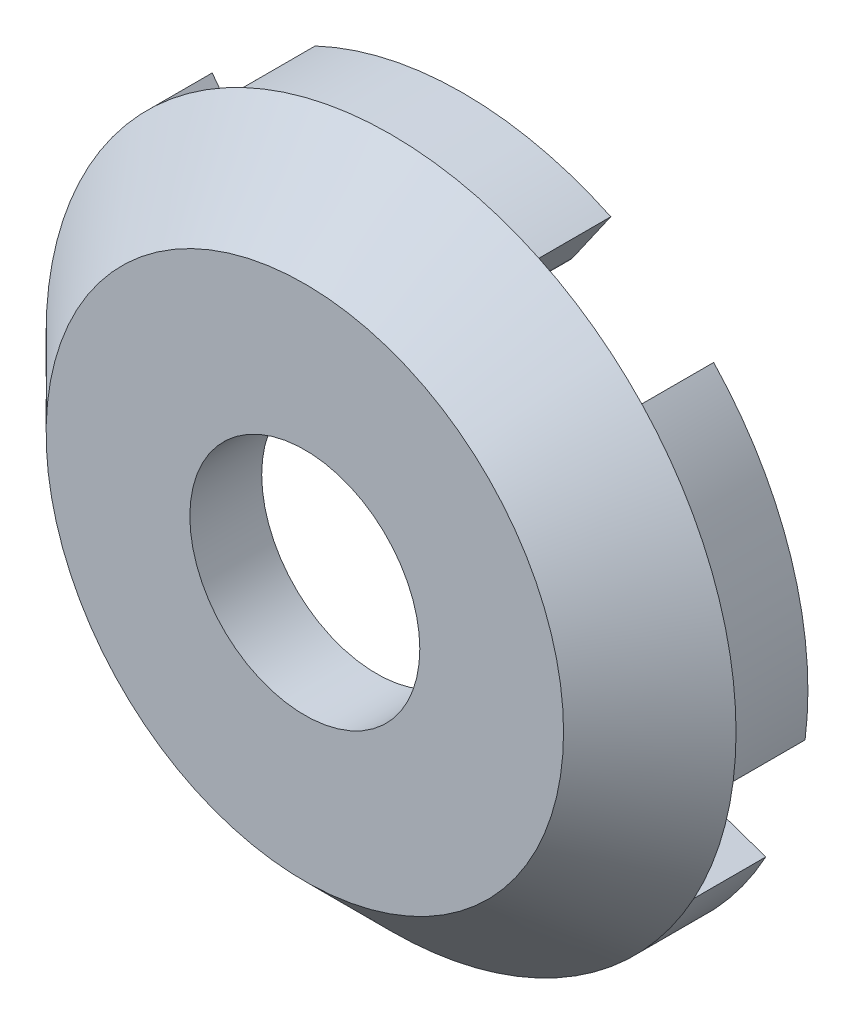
ISO-10303-21;
HEADER;
FILE_DESCRIPTION(('STEP AP214'),'2;1');
FILE_NAME('part.step','',(''),(''),'','','');
FILE_SCHEMA(('AUTOMOTIVE_DESIGN { 1 0 10303 214 1 1 1 1 }'));
ENDSEC;
DATA;
#1=APPLICATION_CONTEXT('core data for automotive mechanical design processes');
#2=APPLICATION_PROTOCOL_DEFINITION('international standard','automotive_design',2000,#1);
#3=PRODUCT_CONTEXT('',#1,'mechanical');
#4=PRODUCT('Part','Part','',(#3));
#5=PRODUCT_RELATED_PRODUCT_CATEGORY('part','',(#4));
#6=PRODUCT_DEFINITION_FORMATION('','',#4);
#7=PRODUCT_DEFINITION_CONTEXT('part definition',#1,'design');
#8=PRODUCT_DEFINITION('design','',#6,#7);
#9=PRODUCT_DEFINITION_SHAPE('','',#8);
#10=(LENGTH_UNIT() NAMED_UNIT(*) SI_UNIT(.MILLI.,.METRE.));
#11=(NAMED_UNIT(*) PLANE_ANGLE_UNIT() SI_UNIT($,.RADIAN.));
#12=(NAMED_UNIT(*) SI_UNIT($,.STERADIAN.) SOLID_ANGLE_UNIT());
#13=UNCERTAINTY_MEASURE_WITH_UNIT(LENGTH_MEASURE(1.E-05),#10,'distance_accuracy_value','');
#14=(GEOMETRIC_REPRESENTATION_CONTEXT(3) GLOBAL_UNCERTAINTY_ASSIGNED_CONTEXT((#13)) GLOBAL_UNIT_ASSIGNED_CONTEXT((#10,
#11,#12)) REPRESENTATION_CONTEXT('',''));
#15=CARTESIAN_POINT('',(0.,0.,0.));
#16=DIRECTION('',(0.,0.,1.));
#17=DIRECTION('',(1.,0.,0.));
#18=AXIS2_PLACEMENT_3D('',#15,#16,#17);
#19=CARTESIAN_POINT('',(0.,0.,2.5));
#20=DIRECTION('',(0.,0.,1.));
#21=DIRECTION('',(1.,0.,0.));
#22=AXIS2_PLACEMENT_3D('',#19,#20,#21);
#23=PLANE('',#22);
#24=DIRECTION('',(-0.603003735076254,-0.797738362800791,0.));
#25=VECTOR('',#24,1.);
#26=CARTESIAN_POINT('',(6.75879444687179,5.64488400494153,2.5));
#27=LINE('',#26,#25);
#28=CARTESIAN_POINT('',(8.72186453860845,8.24190991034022,2.5));
#29=VERTEX_POINT('',#28);
#30=CARTESIAN_POINT('',(7.34038037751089,6.41428787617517,2.5));
#31=VERTEX_POINT('',#30);
#32=EDGE_CURVE('E294',#29,#31,#27,.T.);
#33=ORIENTED_EDGE('',*,*,#32,.T.);
#34=CARTESIAN_POINT('',(8.13811874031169,5.81128414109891,2.5));
#35=DIRECTION('',(0.,0.,1.));
#36=DIRECTION('',(1.,0.,0.));
#37=AXIS2_PLACEMENT_3D('',#34,#35,#36);
#38=CIRCLE('',#37,1.);
#39=CARTESIAN_POINT('',(7.32430686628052,5.23015572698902,2.5));
#40=VERTEX_POINT('',#39);
#41=EDGE_CURVE('E461',#31,#40,#38,.T.);
#42=ORIENTED_EDGE('',*,*,#41,.T.);
#43=CARTESIAN_POINT('',(0.,0.,2.5));
#44=DIRECTION('',(0.,0.,1.));
#45=DIRECTION('',(1.,0.,0.));
#46=AXIS2_PLACEMENT_3D('',#43,#44,#45);
#47=CIRCLE('',#46,9.);
#48=CARTESIAN_POINT('',(2.71083839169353,8.58203677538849,2.5));
#49=VERTEX_POINT('',#48);
#50=EDGE_CURVE('E354',#40,#49,#47,.T.);
#51=ORIENTED_EDGE('',*,*,#50,.T.);
#52=CARTESIAN_POINT('',(3.01204265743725,9.53559641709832,2.5));
#53=DIRECTION('',(0.,0.,1.));
#54=DIRECTION('',(1.,0.,0.));
#55=AXIS2_PLACEMENT_3D('',#52,#53,#54);
#56=CIRCLE('',#55,1.);
#57=CARTESIAN_POINT('',(3.83204800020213,8.96324055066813,2.5));
#58=VERTEX_POINT('',#57);
#59=EDGE_CURVE('E447',#49,#58,#56,.T.);
#60=ORIENTED_EDGE('',*,*,#59,.T.);
#61=DIRECTION('',(0.572355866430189,0.82000534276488,0.));
#62=VECTOR('',#61,1.);
#63=CARTESIAN_POINT('',(5.14331776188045,10.8418763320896,2.5));
#64=LINE('',#63,#62);
#65=CARTESIAN_POINT('',(5.14331776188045,10.8418763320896,2.5));
#66=VERTEX_POINT('',#65);
#67=EDGE_CURVE('E518',#58,#66,#64,.T.);
#68=ORIENTED_EDGE('',*,*,#67,.T.);
#69=CARTESIAN_POINT('',(0.,0.,2.5));
#70=DIRECTION('',(0.,0.,1.));
#71=DIRECTION('',(1.,0.,0.));
#72=AXIS2_PLACEMENT_3D('',#69,#70,#71);
#73=CIRCLE('',#72,12.);
#74=EDGE_CURVE('E274',#29,#66,#73,.T.);
#75=ORIENTED_EDGE('',*,*,#74,.F.);
#76=EDGE_LOOP('',(#33,#42,#51,#60,#68,#75));
#77=FACE_BOUND('',#76,.T.);
#78=ADVANCED_FACE('F34',(#77),#23,.F.);
#79=DIRECTION('',(0.572355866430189,-0.82000534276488,0.));
#80=VECTOR('',#79,1.);
#81=CARTESIAN_POINT('',(-3.28002137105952,8.17236058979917,2.5));
#82=LINE('',#81,#80);
#83=CARTESIAN_POINT('',(-5.14331776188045,10.8418763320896,2.5));
#84=VERTEX_POINT('',#83);
#85=CARTESIAN_POINT('',(-3.83204800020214,8.96324055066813,2.5));
#86=VERTEX_POINT('',#85);
#87=EDGE_CURVE('E521',#84,#86,#82,.T.);
#88=ORIENTED_EDGE('',*,*,#87,.T.);
#89=CARTESIAN_POINT('',(-3.01204265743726,9.53559641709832,2.5));
#90=DIRECTION('',(0.,0.,1.));
#91=DIRECTION('',(1.,0.,0.));
#92=AXIS2_PLACEMENT_3D('',#89,#90,#91);
#93=CIRCLE('',#92,1.);
#94=CARTESIAN_POINT('',(-2.71083839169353,8.58203677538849,2.5));
#95=VERTEX_POINT('',#94);
#96=EDGE_CURVE('E449',#86,#95,#93,.T.);
#97=ORIENTED_EDGE('',*,*,#96,.T.);
#98=CARTESIAN_POINT('',(-7.32430686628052,5.23015572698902,2.5));
#99=VERTEX_POINT('',#98);
#100=EDGE_CURVE('E352',#95,#99,#47,.T.);
#101=ORIENTED_EDGE('',*,*,#100,.T.);
#102=CARTESIAN_POINT('',(-8.13811874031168,5.81128414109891,2.5));
#103=DIRECTION('',(0.,0.,1.));
#104=DIRECTION('',(1.,0.,0.));
#105=AXIS2_PLACEMENT_3D('',#102,#103,#104);
#106=CIRCLE('',#105,1.);
#107=CARTESIAN_POINT('',(-7.34038037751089,6.41428787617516,2.5));
#108=VERTEX_POINT('',#107);
#109=EDGE_CURVE('E238',#99,#108,#106,.T.);
#110=ORIENTED_EDGE('',*,*,#109,.T.);
#111=DIRECTION('',(-0.603003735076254,0.797738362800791,0.));
#112=VECTOR('',#111,1.);
#113=CARTESIAN_POINT('',(-6.7587944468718,5.64488400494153,2.5));
#114=LINE('',#113,#112);
#115=CARTESIAN_POINT('',(-8.72186453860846,8.24190991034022,2.5));
#116=VERTEX_POINT('',#115);
#117=EDGE_CURVE('E230',#108,#116,#114,.T.);
#118=ORIENTED_EDGE('',*,*,#117,.T.);
#119=EDGE_CURVE('E235',#84,#116,#73,.T.);
#120=ORIENTED_EDGE('',*,*,#119,.F.);
#121=EDGE_LOOP('',(#88,#97,#101,#110,#118,#120));
#122=FACE_BOUND('',#121,.T.);
#123=ADVANCED_FACE('F233',(#122),#23,.F.);
#124=DIRECTION('',(0.956739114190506,0.290947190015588,0.));
#125=VECTOR('',#124,1.);
#126=CARTESIAN_POINT('',(-8.78595913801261,-0.594087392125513,2.5));
#127=LINE('',#126,#125);
#128=CARTESIAN_POINT('',(-11.9006097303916,-1.5412618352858,2.5));
#129=VERTEX_POINT('',#128);
#130=CARTESIAN_POINT('',(-9.70871628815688,-0.87470056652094,2.5));
#131=VERTEX_POINT('',#130);
#132=EDGE_CURVE('E243',#129,#131,#127,.T.);
#133=ORIENTED_EDGE('',*,*,#132,.T.);
#134=CARTESIAN_POINT('',(-9.99966347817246,0.0820385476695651,2.5));
#135=DIRECTION('',(0.,0.,1.));
#136=DIRECTION('',(1.,0.,0.));
#137=AXIS2_PLACEMENT_3D('',#134,#135,#136);
#138=CIRCLE('',#137,1.);
#139=CARTESIAN_POINT('',(-8.99969713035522,0.0738346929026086,2.5));
#140=VERTEX_POINT('',#139);
#141=EDGE_CURVE('E452',#131,#140,#138,.T.);
#142=ORIENTED_EDGE('',*,*,#141,.T.);
#143=CARTESIAN_POINT('',(-7.23750897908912,-5.34962276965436,2.5));
#144=VERTEX_POINT('',#143);
#145=EDGE_CURVE('E350',#140,#144,#47,.T.);
#146=ORIENTED_EDGE('',*,*,#145,.T.);
#147=CARTESIAN_POINT('',(-8.04167664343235,-5.94402529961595,2.5));
#148=DIRECTION('',(0.,0.,1.));
#149=DIRECTION('',(1.,0.,0.));
#150=AXIS2_PLACEMENT_3D('',#147,#148,#149);
#151=CIRCLE('',#150,1.);
#152=CARTESIAN_POINT('',(-8.36865256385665,-4.9989926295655,2.5));
#153=VERTEX_POINT('',#152);
#154=EDGE_CURVE('E456',#144,#153,#151,.T.);
#155=ORIENTED_EDGE('',*,*,#154,.T.);
#156=DIRECTION('',(-0.945032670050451,-0.326975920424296,0.));
#157=VECTOR('',#156,1.);
#158=CARTESIAN_POINT('',(-7.45718606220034,-4.68363041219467,2.5));
#159=LINE('',#158,#157);
#160=CARTESIAN_POINT('',(-10.5337264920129,-5.74809587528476,2.5));
#161=VERTEX_POINT('',#160);
#162=EDGE_CURVE('E334',#153,#161,#159,.T.);
#163=ORIENTED_EDGE('',*,*,#162,.T.);
#164=EDGE_CURVE('E272',#129,#161,#73,.T.);
#165=ORIENTED_EDGE('',*,*,#164,.F.);
#166=EDGE_LOOP('',(#133,#142,#146,#155,#163,#165));
#167=FACE_BOUND('',#166,.T.);
#168=ADVANCED_FACE('F597',(#167),#23,.F.);
#169=DIRECTION('',(0.0189414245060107,0.999820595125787,0.));
#170=VECTOR('',#169,1.);
#171=CARTESIAN_POINT('',(-2.15,-8.53952679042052,2.5));
#172=LINE('',#171,#170);
#173=CARTESIAN_POINT('',(-2.21166353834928,-11.7944285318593,2.5));
#174=VERTEX_POINT('',#173);
#175=CARTESIAN_POINT('',(-2.16826865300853,-9.50383523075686,2.5));
#176=VERTEX_POINT('',#175);
#177=EDGE_CURVE('E330',#174,#176,#172,.T.);
#178=ORIENTED_EDGE('',*,*,#177,.T.);
#179=CARTESIAN_POINT('',(-3.16808924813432,-9.48489380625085,2.5));
#180=DIRECTION('',(0.,0.,1.));
#181=DIRECTION('',(1.,0.,0.));
#182=AXIS2_PLACEMENT_3D('',#179,#180,#181);
#183=CIRCLE('',#182,1.);
#184=CARTESIAN_POINT('',(-2.85128032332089,-8.53640442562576,2.5));
#185=VERTEX_POINT('',#184);
#186=EDGE_CURVE('E458',#176,#185,#183,.T.);
#187=ORIENTED_EDGE('',*,*,#186,.T.);
#188=CARTESIAN_POINT('',(2.85128032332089,-8.53640442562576,2.5));
#189=VERTEX_POINT('',#188);
#190=EDGE_CURVE('E567',#185,#189,#47,.T.);
#191=ORIENTED_EDGE('',*,*,#190,.T.);
#192=CARTESIAN_POINT('',(3.16808924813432,-9.48489380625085,2.5));
#193=DIRECTION('',(0.,0.,1.));
#194=DIRECTION('',(1.,0.,0.));
#195=AXIS2_PLACEMENT_3D('',#192,#193,#194);
#196=CIRCLE('',#195,1.);
#197=CARTESIAN_POINT('',(2.16826865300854,-9.50383523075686,2.5));
#198=VERTEX_POINT('',#197);
#199=EDGE_CURVE('E11',#189,#198,#196,.T.);
#200=ORIENTED_EDGE('',*,*,#199,.T.);
#201=DIRECTION('',(0.0189414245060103,-0.999820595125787,0.));
#202=VECTOR('',#201,1.);
#203=CARTESIAN_POINT('',(2.15,-8.53952679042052,2.5));
#204=LINE('',#203,#202);
#205=CARTESIAN_POINT('',(2.21166353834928,-11.7944285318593,2.5));
#206=VERTEX_POINT('',#205);
#207=EDGE_CURVE('E316',#198,#206,#204,.T.);
#208=ORIENTED_EDGE('',*,*,#207,.T.);
#209=EDGE_CURVE('E277',#174,#206,#73,.T.);
#210=ORIENTED_EDGE('',*,*,#209,.F.);
#211=EDGE_LOOP('',(#178,#187,#191,#200,#208,#210));
#212=FACE_BOUND('',#211,.T.);
#213=ADVANCED_FACE('F568',(#212),#23,.F.);
#214=CARTESIAN_POINT('',(0.,0.,5.5));
#215=DIRECTION('',(0.,0.,-1.));
#216=DIRECTION('',(-1.,0.,0.));
#217=AXIS2_PLACEMENT_3D('',#214,#215,#216);
#218=CYLINDRICAL_SURFACE('',#217,4.);
#219=CARTESIAN_POINT('',(0.,0.,5.5));
#220=DIRECTION('',(0.,0.,1.));
#221=DIRECTION('',(1.,0.,0.));
#222=AXIS2_PLACEMENT_3D('',#219,#220,#221);
#223=CIRCLE('',#222,4.);
#224=CARTESIAN_POINT('',(4.,0.,5.5));
#225=VERTEX_POINT('',#224);
#226=EDGE_CURVE('E281',#225,#225,#223,.T.);
#227=ORIENTED_EDGE('',*,*,#226,.T.);
#228=EDGE_LOOP('',(#227));
#229=FACE_BOUND('',#228,.T.);
#230=CARTESIAN_POINT('',(0.,0.,3.));
#231=DIRECTION('',(0.,0.,-1.));
#232=DIRECTION('',(-1.,0.,0.));
#233=AXIS2_PLACEMENT_3D('',#230,#231,#232);
#234=CIRCLE('',#233,4.);
#235=CARTESIAN_POINT('',(-4.,0.,3.));
#236=VERTEX_POINT('',#235);
#237=EDGE_CURVE('E347',#236,#236,#234,.T.);
#238=ORIENTED_EDGE('',*,*,#237,.T.);
#239=EDGE_LOOP('',(#238));
#240=FACE_BOUND('',#239,.T.);
#241=ADVANCED_FACE('F630',(#229,#240),#218,.F.);
#242=CARTESIAN_POINT('',(0.,0.,2.5));
#243=DIRECTION('',(0.,0.,-1.));
#244=DIRECTION('',(-1.,0.,0.));
#245=AXIS2_PLACEMENT_3D('',#242,#243,#244);
#246=CYLINDRICAL_SURFACE('',#245,12.);
#247=DIRECTION('',(0.,0.,-1.));
#248=VECTOR('',#247,1.);
#249=CARTESIAN_POINT('',(10.5337264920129,-5.74809587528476,2.5));
#250=LINE('',#249,#248);
#251=CARTESIAN_POINT('',(10.5337264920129,-5.74809587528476,2.5));
#252=VERTEX_POINT('',#251);
#253=CARTESIAN_POINT('',(10.5337264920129,-5.74809587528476,0.));
#254=VERTEX_POINT('',#253);
#255=EDGE_CURVE('E309',#252,#254,#250,.T.);
#256=ORIENTED_EDGE('',*,*,#255,.F.);
#257=CARTESIAN_POINT('',(0.,0.,2.49999999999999));
#258=DIRECTION('',(0.,0.,1.));
#259=DIRECTION('',(1.,0.,0.));
#260=AXIS2_PLACEMENT_3D('',#257,#258,#259);
#261=CIRCLE('',#260,12.);
#262=EDGE_CURVE('E483',#252,#206,#261,.F.);
#263=ORIENTED_EDGE('',*,*,#262,.T.);
#264=DIRECTION('',(0.,0.,-1.));
#265=VECTOR('',#264,1.);
#266=CARTESIAN_POINT('',(2.21166353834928,-11.7944285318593,2.5));
#267=LINE('',#266,#265);
#268=CARTESIAN_POINT('',(2.21166353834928,-11.7944285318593,0.));
#269=VERTEX_POINT('',#268);
#270=EDGE_CURVE('E303',#206,#269,#267,.T.);
#271=ORIENTED_EDGE('',*,*,#270,.T.);
#272=CARTESIAN_POINT('',(0.,0.,0.));
#273=DIRECTION('',(0.,0.,1.));
#274=DIRECTION('',(1.,0.,0.));
#275=AXIS2_PLACEMENT_3D('',#272,#273,#274);
#276=CIRCLE('',#275,12.);
#277=EDGE_CURVE('E317',#269,#254,#276,.T.);
#278=ORIENTED_EDGE('',*,*,#277,.T.);
#279=EDGE_LOOP('',(#256,#263,#271,#278));
#280=FACE_BOUND('',#279,.T.);
#281=ADVANCED_FACE('F482',(#280),#246,.T.);
#282=DIRECTION('',(0.,0.,-1.));
#283=VECTOR('',#282,1.);
#284=CARTESIAN_POINT('',(-2.21166353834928,-11.7944285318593,2.5));
#285=LINE('',#284,#283);
#286=CARTESIAN_POINT('',(-2.21166353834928,-11.7944285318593,0.));
#287=VERTEX_POINT('',#286);
#288=EDGE_CURVE('E327',#174,#287,#285,.T.);
#289=ORIENTED_EDGE('',*,*,#288,.F.);
#290=CARTESIAN_POINT('',(0.,0.,2.49999999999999));
#291=DIRECTION('',(0.,0.,1.));
#292=DIRECTION('',(1.,0.,0.));
#293=AXIS2_PLACEMENT_3D('',#290,#291,#292);
#294=CIRCLE('',#293,12.);
#295=EDGE_CURVE('E259',#174,#161,#294,.F.);
#296=ORIENTED_EDGE('',*,*,#295,.T.);
#297=DIRECTION('',(0.,0.,-1.));
#298=VECTOR('',#297,1.);
#299=CARTESIAN_POINT('',(-10.5337264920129,-5.74809587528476,2.5));
#300=LINE('',#299,#298);
#301=CARTESIAN_POINT('',(-10.5337264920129,-5.74809587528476,0.));
#302=VERTEX_POINT('',#301);
#303=EDGE_CURVE('E321',#161,#302,#300,.T.);
#304=ORIENTED_EDGE('',*,*,#303,.T.);
#305=CARTESIAN_POINT('',(0.,0.,0.));
#306=DIRECTION('',(0.,0.,1.));
#307=DIRECTION('',(1.,0.,0.));
#308=AXIS2_PLACEMENT_3D('',#305,#306,#307);
#309=CIRCLE('',#308,12.);
#310=EDGE_CURVE('E335',#302,#287,#309,.T.);
#311=ORIENTED_EDGE('',*,*,#310,.T.);
#312=EDGE_LOOP('',(#289,#296,#304,#311));
#313=FACE_BOUND('',#312,.T.);
#314=ADVANCED_FACE('F585',(#313),#246,.T.);
#315=DIRECTION('',(0.,0.,-1.));
#316=VECTOR('',#315,1.);
#317=CARTESIAN_POINT('',(-11.9006097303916,-1.5412618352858,2.5));
#318=LINE('',#317,#316);
#319=CARTESIAN_POINT('',(-11.9006097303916,-1.5412618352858,0.));
#320=VERTEX_POINT('',#319);
#321=EDGE_CURVE('E255',#129,#320,#318,.T.);
#322=ORIENTED_EDGE('',*,*,#321,.F.);
#323=CARTESIAN_POINT('',(0.,0.,2.49999999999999));
#324=DIRECTION('',(0.,0.,1.));
#325=DIRECTION('',(1.,0.,0.));
#326=AXIS2_PLACEMENT_3D('',#323,#324,#325);
#327=CIRCLE('',#326,12.);
#328=EDGE_CURVE('E250',#129,#116,#327,.F.);
#329=ORIENTED_EDGE('',*,*,#328,.T.);
#330=DIRECTION('',(0.,0.,-1.));
#331=VECTOR('',#330,1.);
#332=CARTESIAN_POINT('',(-8.72186453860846,8.24190991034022,2.5));
#333=LINE('',#332,#331);
#334=CARTESIAN_POINT('',(-8.72186453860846,8.24190991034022,0.));
#335=VERTEX_POINT('',#334);
#336=EDGE_CURVE('E252',#116,#335,#333,.T.);
#337=ORIENTED_EDGE('',*,*,#336,.T.);
#338=CARTESIAN_POINT('',(0.,0.,0.));
#339=DIRECTION('',(0.,0.,1.));
#340=DIRECTION('',(1.,0.,0.));
#341=AXIS2_PLACEMENT_3D('',#338,#339,#340);
#342=CIRCLE('',#341,12.);
#343=EDGE_CURVE('E344',#335,#320,#342,.T.);
#344=ORIENTED_EDGE('',*,*,#343,.T.);
#345=EDGE_LOOP('',(#322,#329,#337,#344));
#346=FACE_BOUND('',#345,.T.);
#347=ADVANCED_FACE('F251',(#346),#246,.T.);
#348=DIRECTION('',(0.,0.,-1.));
#349=VECTOR('',#348,1.);
#350=CARTESIAN_POINT('',(-5.14331776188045,10.8418763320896,2.5));
#351=LINE('',#350,#349);
#352=CARTESIAN_POINT('',(-5.14331776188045,10.8418763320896,0.));
#353=VERTEX_POINT('',#352);
#354=EDGE_CURVE('E517',#84,#353,#351,.T.);
#355=ORIENTED_EDGE('',*,*,#354,.F.);
#356=CARTESIAN_POINT('',(0.,0.,2.49999999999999));
#357=DIRECTION('',(0.,0.,1.));
#358=DIRECTION('',(1.,0.,0.));
#359=AXIS2_PLACEMENT_3D('',#356,#357,#358);
#360=CIRCLE('',#359,12.);
#361=EDGE_CURVE('E260',#84,#66,#360,.F.);
#362=ORIENTED_EDGE('',*,*,#361,.T.);
#363=DIRECTION('',(0.,0.,-1.));
#364=VECTOR('',#363,1.);
#365=CARTESIAN_POINT('',(5.14331776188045,10.8418763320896,2.5));
#366=LINE('',#365,#364);
#367=CARTESIAN_POINT('',(5.14331776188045,10.8418763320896,0.));
#368=VERTEX_POINT('',#367);
#369=EDGE_CURVE('E523',#66,#368,#366,.T.);
#370=ORIENTED_EDGE('',*,*,#369,.T.);
#371=CARTESIAN_POINT('',(0.,0.,0.));
#372=DIRECTION('',(0.,0.,1.));
#373=DIRECTION('',(1.,0.,0.));
#374=AXIS2_PLACEMENT_3D('',#371,#372,#373);
#375=CIRCLE('',#374,12.);
#376=EDGE_CURVE('E275',#368,#353,#375,.T.);
#377=ORIENTED_EDGE('',*,*,#376,.T.);
#378=EDGE_LOOP('',(#355,#362,#370,#377));
#379=FACE_BOUND('',#378,.T.);
#380=ADVANCED_FACE('F535',(#379),#246,.T.);
#381=DIRECTION('',(-0.945032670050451,0.326975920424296,0.));
#382=VECTOR('',#381,1.);
#383=CARTESIAN_POINT('',(7.45718606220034,-4.68363041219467,2.5));
#384=LINE('',#383,#382);
#385=CARTESIAN_POINT('',(8.36865256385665,-4.9989926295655,2.5));
#386=VERTEX_POINT('',#385);
#387=EDGE_CURVE('E312',#252,#386,#384,.T.);
#388=ORIENTED_EDGE('',*,*,#387,.T.);
#389=CARTESIAN_POINT('',(8.04167664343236,-5.94402529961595,2.5));
#390=DIRECTION('',(0.,0.,1.));
#391=DIRECTION('',(1.,0.,0.));
#392=AXIS2_PLACEMENT_3D('',#389,#390,#391);
#393=CIRCLE('',#392,1.);
#394=CARTESIAN_POINT('',(7.23750897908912,-5.34962276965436,2.5));
#395=VERTEX_POINT('',#394);
#396=EDGE_CURVE('E42',#386,#395,#393,.T.);
#397=ORIENTED_EDGE('',*,*,#396,.T.);
#398=CARTESIAN_POINT('',(8.99969713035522,0.0738346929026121,2.5));
#399=VERTEX_POINT('',#398);
#400=EDGE_CURVE('E468',#395,#399,#47,.T.);
#401=ORIENTED_EDGE('',*,*,#400,.T.);
#402=CARTESIAN_POINT('',(9.99966347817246,0.082038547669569,2.5));
#403=DIRECTION('',(0.,0.,1.));
#404=DIRECTION('',(1.,0.,0.));
#405=AXIS2_PLACEMENT_3D('',#402,#403,#404);
#406=CIRCLE('',#405,1.);
#407=CARTESIAN_POINT('',(9.70871628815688,-0.874700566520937,2.5));
#408=VERTEX_POINT('',#407);
#409=EDGE_CURVE('E464',#399,#408,#406,.T.);
#410=ORIENTED_EDGE('',*,*,#409,.T.);
#411=DIRECTION('',(0.956739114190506,-0.290947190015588,0.));
#412=VECTOR('',#411,1.);
#413=CARTESIAN_POINT('',(8.78595913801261,-0.594087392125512,2.5));
#414=LINE('',#413,#412);
#415=CARTESIAN_POINT('',(11.9006097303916,-1.54126183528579,2.5));
#416=VERTEX_POINT('',#415);
#417=EDGE_CURVE('E298',#408,#416,#414,.T.);
#418=ORIENTED_EDGE('',*,*,#417,.T.);
#419=EDGE_CURVE('E280',#252,#416,#73,.T.);
#420=ORIENTED_EDGE('',*,*,#419,.F.);
#421=EDGE_LOOP('',(#388,#397,#401,#410,#418,#420));
#422=FACE_BOUND('',#421,.T.);
#423=ADVANCED_FACE('F467',(#422),#23,.F.);
#424=CARTESIAN_POINT('',(5.14331776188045,10.8418763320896,2.5));
#425=DIRECTION('',(-0.82000534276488,0.572355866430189,0.));
#426=DIRECTION('',(-0.572355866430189,-0.82000534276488,0.));
#427=AXIS2_PLACEMENT_3D('',#424,#425,#426);
#428=PLANE('',#427);
#429=ORIENTED_EDGE('',*,*,#67,.F.);
#430=DIRECTION('',(0.,0.,-1.));
#431=VECTOR('',#430,1.);
#432=CARTESIAN_POINT('',(3.83204800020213,8.96324055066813,2.5));
#433=LINE('',#432,#431);
#434=CARTESIAN_POINT('',(3.83204800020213,8.96324055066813,0.));
#435=VERTEX_POINT('',#434);
#436=EDGE_CURVE('E494',#58,#435,#433,.T.);
#437=ORIENTED_EDGE('',*,*,#436,.T.);
#438=DIRECTION('',(0.572355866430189,0.82000534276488,0.));
#439=VECTOR('',#438,1.);
#440=CARTESIAN_POINT('',(5.14331776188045,10.8418763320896,0.));
#441=LINE('',#440,#439);
#442=EDGE_CURVE('E271',#435,#368,#441,.T.);
#443=ORIENTED_EDGE('',*,*,#442,.T.);
#444=ORIENTED_EDGE('',*,*,#369,.F.);
#445=EDGE_LOOP('',(#429,#437,#443,#444));
#446=FACE_BOUND('',#445,.T.);
#447=ADVANCED_FACE('F538',(#446),#428,.F.);
#448=DIRECTION('',(0.,0.,-1.));
#449=VECTOR('',#448,1.);
#450=CARTESIAN_POINT('',(8.72186453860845,8.24190991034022,2.5));
#451=LINE('',#450,#449);
#452=CARTESIAN_POINT('',(8.72186453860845,8.24190991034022,0.));
#453=VERTEX_POINT('',#452);
#454=EDGE_CURVE('E289',#29,#453,#451,.T.);
#455=ORIENTED_EDGE('',*,*,#454,.F.);
#456=CARTESIAN_POINT('',(0.,0.,2.49999999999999));
#457=DIRECTION('',(0.,0.,1.));
#458=DIRECTION('',(1.,0.,0.));
#459=AXIS2_PLACEMENT_3D('',#456,#457,#458);
#460=CIRCLE('',#459,12.);
#461=EDGE_CURVE('E487',#29,#416,#460,.F.);
#462=ORIENTED_EDGE('',*,*,#461,.T.);
#463=DIRECTION('',(0.,0.,-1.));
#464=VECTOR('',#463,1.);
#465=CARTESIAN_POINT('',(11.9006097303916,-1.54126183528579,2.5));
#466=LINE('',#465,#464);
#467=CARTESIAN_POINT('',(11.9006097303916,-1.54126183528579,0.));
#468=VERTEX_POINT('',#467);
#469=EDGE_CURVE('E285',#416,#468,#466,.T.);
#470=ORIENTED_EDGE('',*,*,#469,.T.);
#471=CARTESIAN_POINT('',(0.,0.,0.));
#472=DIRECTION('',(0.,0.,1.));
#473=DIRECTION('',(1.,0.,0.));
#474=AXIS2_PLACEMENT_3D('',#471,#472,#473);
#475=CIRCLE('',#474,12.);
#476=EDGE_CURVE('E299',#468,#453,#475,.T.);
#477=ORIENTED_EDGE('',*,*,#476,.T.);
#478=EDGE_LOOP('',(#455,#462,#470,#477));
#479=FACE_BOUND('',#478,.T.);
#480=ADVANCED_FACE('F558',(#479),#246,.T.);
#481=CARTESIAN_POINT('',(-3.28002137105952,8.17236058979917,2.5));
#482=DIRECTION('',(0.82000534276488,0.572355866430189,0.));
#483=DIRECTION('',(-0.572355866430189,0.82000534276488,0.));
#484=AXIS2_PLACEMENT_3D('',#481,#482,#483);
#485=PLANE('',#484);
#486=DIRECTION('',(0.572355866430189,-0.82000534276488,0.));
#487=VECTOR('',#486,1.);
#488=CARTESIAN_POINT('',(-3.28002137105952,8.17236058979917,0.));
#489=LINE('',#488,#487);
#490=CARTESIAN_POINT('',(-3.83204800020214,8.96324055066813,0.));
#491=VERTEX_POINT('',#490);
#492=EDGE_CURVE('E509',#353,#491,#489,.T.);
#493=ORIENTED_EDGE('',*,*,#492,.T.);
#494=DIRECTION('',(0.,0.,-1.));
#495=VECTOR('',#494,1.);
#496=CARTESIAN_POINT('',(-3.83204800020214,8.96324055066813,2.5));
#497=LINE('',#496,#495);
#498=EDGE_CURVE('E407',#491,#86,#497,.F.);
#499=ORIENTED_EDGE('',*,*,#498,.T.);
#500=ORIENTED_EDGE('',*,*,#87,.F.);
#501=ORIENTED_EDGE('',*,*,#354,.T.);
#502=EDGE_LOOP('',(#493,#499,#500,#501));
#503=FACE_BOUND('',#502,.T.);
#504=ADVANCED_FACE('F515',(#503),#485,.F.);
#505=CARTESIAN_POINT('',(0.,10.4617840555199,0.));
#506=DIRECTION('',(0.,0.,1.));
#507=DIRECTION('',(1.,0.,0.));
#508=AXIS2_PLACEMENT_3D('',#505,#506,#507);
#509=PLANE('',#508);
#510=ORIENTED_EDGE('',*,*,#442,.F.);
#511=CARTESIAN_POINT('',(3.01204265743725,9.53559641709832,0.));
#512=DIRECTION('',(0.,0.,1.));
#513=DIRECTION('',(1.,0.,0.));
#514=AXIS2_PLACEMENT_3D('',#511,#512,#513);
#515=CIRCLE('',#514,1.);
#516=CARTESIAN_POINT('',(2.71083839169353,8.58203677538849,0.));
#517=VERTEX_POINT('',#516);
#518=EDGE_CURVE('E382',#435,#517,#515,.F.);
#519=ORIENTED_EDGE('',*,*,#518,.T.);
#520=CARTESIAN_POINT('',(0.,0.,0.));
#521=DIRECTION('',(0.,0.,-1.));
#522=DIRECTION('',(-1.,0.,0.));
#523=AXIS2_PLACEMENT_3D('',#520,#521,#522);
#524=CIRCLE('',#523,9.);
#525=CARTESIAN_POINT('',(-2.71083839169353,8.58203677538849,0.));
#526=VERTEX_POINT('',#525);
#527=EDGE_CURVE('E359',#526,#517,#524,.T.);
#528=ORIENTED_EDGE('',*,*,#527,.F.);
#529=CARTESIAN_POINT('',(-3.01204265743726,9.53559641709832,0.));
#530=DIRECTION('',(0.,0.,1.));
#531=DIRECTION('',(1.,0.,0.));
#532=AXIS2_PLACEMENT_3D('',#529,#530,#531);
#533=CIRCLE('',#532,1.);
#534=EDGE_CURVE('E386',#526,#491,#533,.F.);
#535=ORIENTED_EDGE('',*,*,#534,.T.);
#536=ORIENTED_EDGE('',*,*,#492,.F.);
#537=ORIENTED_EDGE('',*,*,#376,.F.);
#538=EDGE_LOOP('',(#510,#519,#528,#535,#536,#537));
#539=FACE_BOUND('',#538,.T.);
#540=ADVANCED_FACE('F507',(#539),#509,.F.);
#541=CARTESIAN_POINT('',(0.,0.,5.5));
#542=DIRECTION('',(0.,0.,1.));
#543=DIRECTION('',(1.,0.,0.));
#544=AXIS2_PLACEMENT_3D('',#541,#542,#543);
#545=PLANE('',#544);
#546=CARTESIAN_POINT('',(0.,0.,5.5));
#547=DIRECTION('',(0.,0.,1.));
#548=DIRECTION('',(1.,0.,0.));
#549=AXIS2_PLACEMENT_3D('',#546,#547,#548);
#550=CIRCLE('',#549,9.00000000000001);
#551=CARTESIAN_POINT('',(9.00000000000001,0.,5.5));
#552=VERTEX_POINT('',#551);
#553=EDGE_CURVE('E529',#552,#552,#550,.T.);
#554=ORIENTED_EDGE('',*,*,#553,.T.);
#555=EDGE_LOOP('',(#554));
#556=FACE_BOUND('',#555,.T.);
#557=ORIENTED_EDGE('',*,*,#226,.F.);
#558=EDGE_LOOP('',(#557));
#559=FACE_BOUND('',#558,.T.);
#560=ADVANCED_FACE('F682',(#556,#559),#545,.T.);
#561=CARTESIAN_POINT('',(8.78595913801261,-0.594087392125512,2.5));
#562=DIRECTION('',(0.290947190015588,0.956739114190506,0.));
#563=DIRECTION('',(-0.956739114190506,0.290947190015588,0.));
#564=AXIS2_PLACEMENT_3D('',#561,#562,#563);
#565=PLANE('',#564);
#566=ORIENTED_EDGE('',*,*,#417,.F.);
#567=DIRECTION('',(0.,0.,-1.));
#568=VECTOR('',#567,1.);
#569=CARTESIAN_POINT('',(9.70871628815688,-0.874700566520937,2.5));
#570=LINE('',#569,#568);
#571=CARTESIAN_POINT('',(9.70871628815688,-0.874700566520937,0.));
#572=VERTEX_POINT('',#571);
#573=EDGE_CURVE('E436',#408,#572,#570,.T.);
#574=ORIENTED_EDGE('',*,*,#573,.T.);
#575=DIRECTION('',(0.956739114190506,-0.290947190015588,0.));
#576=VECTOR('',#575,1.);
#577=CARTESIAN_POINT('',(8.78595913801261,-0.594087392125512,0.));
#578=LINE('',#577,#576);
#579=EDGE_CURVE('E301',#572,#468,#578,.T.);
#580=ORIENTED_EDGE('',*,*,#579,.T.);
#581=ORIENTED_EDGE('',*,*,#469,.F.);
#582=EDGE_LOOP('',(#566,#574,#580,#581));
#583=FACE_BOUND('',#582,.T.);
#584=ADVANCED_FACE('F562',(#583),#565,.F.);
#585=CARTESIAN_POINT('',(6.75879444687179,5.64488400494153,2.5));
#586=DIRECTION('',(0.797738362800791,-0.603003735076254,0.));
#587=DIRECTION('',(0.603003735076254,0.797738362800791,0.));
#588=AXIS2_PLACEMENT_3D('',#585,#586,#587);
#589=PLANE('',#588);
#590=DIRECTION('',(-0.603003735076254,-0.797738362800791,0.));
#591=VECTOR('',#590,1.);
#592=CARTESIAN_POINT('',(6.75879444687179,5.64488400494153,0.));
#593=LINE('',#592,#591);
#594=CARTESIAN_POINT('',(7.34038037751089,6.41428787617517,0.));
#595=VERTEX_POINT('',#594);
#596=EDGE_CURVE('E295',#453,#595,#593,.T.);
#597=ORIENTED_EDGE('',*,*,#596,.T.);
#598=DIRECTION('',(0.,0.,-1.));
#599=VECTOR('',#598,1.);
#600=CARTESIAN_POINT('',(7.34038037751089,6.41428787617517,2.5));
#601=LINE('',#600,#599);
#602=EDGE_CURVE('E429',#595,#31,#601,.F.);
#603=ORIENTED_EDGE('',*,*,#602,.T.);
#604=ORIENTED_EDGE('',*,*,#32,.F.);
#605=ORIENTED_EDGE('',*,*,#454,.T.);
#606=EDGE_LOOP('',(#597,#603,#604,#605));
#607=FACE_BOUND('',#606,.T.);
#608=ADVANCED_FACE('F555',(#607),#589,.F.);
#609=CARTESIAN_POINT('',(9.94974789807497,3.23286906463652,0.));
#610=DIRECTION('',(0.,0.,1.));
#611=DIRECTION('',(1.,0.,0.));
#612=AXIS2_PLACEMENT_3D('',#609,#610,#611);
#613=PLANE('',#612);
#614=CARTESIAN_POINT('',(7.32430686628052,5.23015572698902,0.));
#615=VERTEX_POINT('',#614);
#616=CARTESIAN_POINT('',(8.99969713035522,0.0738346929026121,0.));
#617=VERTEX_POINT('',#616);
#618=EDGE_CURVE('E364',#615,#617,#524,.T.);
#619=ORIENTED_EDGE('',*,*,#618,.F.);
#620=CARTESIAN_POINT('',(8.13811874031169,5.81128414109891,0.));
#621=DIRECTION('',(0.,0.,1.));
#622=DIRECTION('',(1.,0.,0.));
#623=AXIS2_PLACEMENT_3D('',#620,#621,#622);
#624=CIRCLE('',#623,1.);
#625=EDGE_CURVE('E434',#615,#595,#624,.F.);
#626=ORIENTED_EDGE('',*,*,#625,.T.);
#627=ORIENTED_EDGE('',*,*,#596,.F.);
#628=ORIENTED_EDGE('',*,*,#476,.F.);
#629=ORIENTED_EDGE('',*,*,#579,.F.);
#630=CARTESIAN_POINT('',(9.99966347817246,0.082038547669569,0.));
#631=DIRECTION('',(0.,0.,1.));
#632=DIRECTION('',(1.,0.,0.));
#633=AXIS2_PLACEMENT_3D('',#630,#631,#632);
#634=CIRCLE('',#633,1.);
#635=EDGE_CURVE('E432',#572,#617,#634,.F.);
#636=ORIENTED_EDGE('',*,*,#635,.T.);
#637=EDGE_LOOP('',(#619,#626,#627,#628,#629,#636));
#638=FACE_BOUND('',#637,.T.);
#639=ADVANCED_FACE('F552',(#638),#613,.F.);
#640=CARTESIAN_POINT('',(2.15,-8.53952679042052,2.5));
#641=DIRECTION('',(0.999820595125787,0.0189414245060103,0.));
#642=DIRECTION('',(-0.0189414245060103,0.999820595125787,0.));
#643=AXIS2_PLACEMENT_3D('',#640,#641,#642);
#644=PLANE('',#643);
#645=ORIENTED_EDGE('',*,*,#207,.F.);
#646=DIRECTION('',(0.,0.,-1.));
#647=VECTOR('',#646,1.);
#648=CARTESIAN_POINT('',(2.16826865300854,-9.50383523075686,2.5));
#649=LINE('',#648,#647);
#650=CARTESIAN_POINT('',(2.16826865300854,-9.50383523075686,0.));
#651=VERTEX_POINT('',#650);
#652=EDGE_CURVE('E445',#198,#651,#649,.T.);
#653=ORIENTED_EDGE('',*,*,#652,.T.);
#654=DIRECTION('',(0.0189414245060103,-0.999820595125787,0.));
#655=VECTOR('',#654,1.);
#656=CARTESIAN_POINT('',(2.15,-8.53952679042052,0.));
#657=LINE('',#656,#655);
#658=EDGE_CURVE('E319',#651,#269,#657,.T.);
#659=ORIENTED_EDGE('',*,*,#658,.T.);
#660=ORIENTED_EDGE('',*,*,#270,.F.);
#661=EDGE_LOOP('',(#645,#653,#659,#660));
#662=FACE_BOUND('',#661,.T.);
#663=ADVANCED_FACE('F889',(#662),#644,.F.);
#664=CARTESIAN_POINT('',(7.45718606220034,-4.68363041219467,2.5));
#665=DIRECTION('',(-0.326975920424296,-0.945032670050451,0.));
#666=DIRECTION('',(0.945032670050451,-0.326975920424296,0.));
#667=AXIS2_PLACEMENT_3D('',#664,#665,#666);
#668=PLANE('',#667);
#669=DIRECTION('',(-0.945032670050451,0.326975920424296,0.));
#670=VECTOR('',#669,1.);
#671=CARTESIAN_POINT('',(7.45718606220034,-4.68363041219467,0.));
#672=LINE('',#671,#670);
#673=CARTESIAN_POINT('',(8.36865256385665,-4.9989926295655,0.));
#674=VERTEX_POINT('',#673);
#675=EDGE_CURVE('E313',#254,#674,#672,.T.);
#676=ORIENTED_EDGE('',*,*,#675,.T.);
#677=DIRECTION('',(0.,0.,-1.));
#678=VECTOR('',#677,1.);
#679=CARTESIAN_POINT('',(8.36865256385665,-4.9989926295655,2.5));
#680=LINE('',#679,#678);
#681=EDGE_CURVE('E439',#674,#386,#680,.F.);
#682=ORIENTED_EDGE('',*,*,#681,.T.);
#683=ORIENTED_EDGE('',*,*,#387,.F.);
#684=ORIENTED_EDGE('',*,*,#255,.T.);
#685=EDGE_LOOP('',(#676,#682,#683,#684));
#686=FACE_BOUND('',#685,.T.);
#687=ADVANCED_FACE('F478',(#686),#668,.F.);
#688=CARTESIAN_POINT('',(6.14928238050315,-8.46376109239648,0.));
#689=DIRECTION('',(0.,0.,1.));
#690=DIRECTION('',(1.,0.,0.));
#691=AXIS2_PLACEMENT_3D('',#688,#689,#690);
#692=PLANE('',#691);
#693=CARTESIAN_POINT('',(7.23750897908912,-5.34962276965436,0.));
#694=VERTEX_POINT('',#693);
#695=CARTESIAN_POINT('',(2.85128032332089,-8.53640442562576,0.));
#696=VERTEX_POINT('',#695);
#697=EDGE_CURVE('E358',#694,#696,#524,.T.);
#698=ORIENTED_EDGE('',*,*,#697,.F.);
#699=CARTESIAN_POINT('',(8.04167664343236,-5.94402529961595,0.));
#700=DIRECTION('',(0.,0.,1.));
#701=DIRECTION('',(1.,0.,0.));
#702=AXIS2_PLACEMENT_3D('',#699,#700,#701);
#703=CIRCLE('',#702,1.);
#704=EDGE_CURVE('E443',#694,#674,#703,.F.);
#705=ORIENTED_EDGE('',*,*,#704,.T.);
#706=ORIENTED_EDGE('',*,*,#675,.F.);
#707=ORIENTED_EDGE('',*,*,#277,.F.);
#708=ORIENTED_EDGE('',*,*,#658,.F.);
#709=CARTESIAN_POINT('',(3.16808924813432,-9.48489380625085,0.));
#710=DIRECTION('',(0.,0.,1.));
#711=DIRECTION('',(1.,0.,0.));
#712=AXIS2_PLACEMENT_3D('',#709,#710,#711);
#713=CIRCLE('',#712,1.);
#714=EDGE_CURVE('E55',#651,#696,#713,.F.);
#715=ORIENTED_EDGE('',*,*,#714,.T.);
#716=EDGE_LOOP('',(#698,#705,#706,#707,#708,#715));
#717=FACE_BOUND('',#716,.T.);
#718=ADVANCED_FACE('F475',(#717),#692,.F.);
#719=CARTESIAN_POINT('',(-7.45718606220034,-4.68363041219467,2.5));
#720=DIRECTION('',(0.326975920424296,-0.945032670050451,0.));
#721=DIRECTION('',(0.945032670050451,0.326975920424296,0.));
#722=AXIS2_PLACEMENT_3D('',#719,#720,#721);
#723=PLANE('',#722);
#724=ORIENTED_EDGE('',*,*,#162,.F.);
#725=DIRECTION('',(0.,0.,-1.));
#726=VECTOR('',#725,1.);
#727=CARTESIAN_POINT('',(-8.36865256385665,-4.9989926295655,2.5));
#728=LINE('',#727,#726);
#729=CARTESIAN_POINT('',(-8.36865256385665,-4.9989926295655,0.));
#730=VERTEX_POINT('',#729);
#731=EDGE_CURVE('E419',#153,#730,#728,.T.);
#732=ORIENTED_EDGE('',*,*,#731,.T.);
#733=DIRECTION('',(-0.945032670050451,-0.326975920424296,0.));
#734=VECTOR('',#733,1.);
#735=CARTESIAN_POINT('',(-7.45718606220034,-4.68363041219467,0.));
#736=LINE('',#735,#734);
#737=EDGE_CURVE('E265',#730,#302,#736,.T.);
#738=ORIENTED_EDGE('',*,*,#737,.T.);
#739=ORIENTED_EDGE('',*,*,#303,.F.);
#740=EDGE_LOOP('',(#724,#732,#738,#739));
#741=FACE_BOUND('',#740,.T.);
#742=ADVANCED_FACE('F589',(#741),#723,.F.);
#743=CARTESIAN_POINT('',(-2.15,-8.53952679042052,2.5));
#744=DIRECTION('',(-0.999820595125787,0.0189414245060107,0.));
#745=DIRECTION('',(-0.0189414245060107,-0.999820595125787,0.));
#746=AXIS2_PLACEMENT_3D('',#743,#744,#745);
#747=PLANE('',#746);
#748=DIRECTION('',(0.0189414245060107,0.999820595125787,0.));
#749=VECTOR('',#748,1.);
#750=CARTESIAN_POINT('',(-2.15,-8.53952679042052,0.));
#751=LINE('',#750,#749);
#752=CARTESIAN_POINT('',(-2.16826865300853,-9.50383523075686,0.));
#753=VERTEX_POINT('',#752);
#754=EDGE_CURVE('E331',#287,#753,#751,.T.);
#755=ORIENTED_EDGE('',*,*,#754,.T.);
#756=DIRECTION('',(0.,0.,-1.));
#757=VECTOR('',#756,1.);
#758=CARTESIAN_POINT('',(-2.16826865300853,-9.50383523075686,2.5));
#759=LINE('',#758,#757);
#760=EDGE_CURVE('E426',#753,#176,#759,.F.);
#761=ORIENTED_EDGE('',*,*,#760,.T.);
#762=ORIENTED_EDGE('',*,*,#177,.F.);
#763=ORIENTED_EDGE('',*,*,#288,.T.);
#764=EDGE_LOOP('',(#755,#761,#762,#763));
#765=FACE_BOUND('',#764,.T.);
#766=ADVANCED_FACE('F581',(#765),#747,.F.);
#767=CARTESIAN_POINT('',(-6.14928238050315,-8.46376109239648,0.));
#768=DIRECTION('',(0.,0.,1.));
#769=DIRECTION('',(1.,0.,0.));
#770=AXIS2_PLACEMENT_3D('',#767,#768,#769);
#771=PLANE('',#770);
#772=ORIENTED_EDGE('',*,*,#737,.F.);
#773=CARTESIAN_POINT('',(-8.04167664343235,-5.94402529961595,0.));
#774=DIRECTION('',(0.,0.,1.));
#775=DIRECTION('',(1.,0.,0.));
#776=AXIS2_PLACEMENT_3D('',#773,#774,#775);
#777=CIRCLE('',#776,1.);
#778=CARTESIAN_POINT('',(-7.23750897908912,-5.34962276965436,0.));
#779=VERTEX_POINT('',#778);
#780=EDGE_CURVE('E424',#730,#779,#777,.F.);
#781=ORIENTED_EDGE('',*,*,#780,.T.);
#782=CARTESIAN_POINT('',(-2.85128032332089,-8.53640442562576,0.));
#783=VERTEX_POINT('',#782);
#784=EDGE_CURVE('E355',#783,#779,#524,.T.);
#785=ORIENTED_EDGE('',*,*,#784,.F.);
#786=CARTESIAN_POINT('',(-3.16808924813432,-9.48489380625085,0.));
#787=DIRECTION('',(0.,0.,1.));
#788=DIRECTION('',(1.,0.,0.));
#789=AXIS2_PLACEMENT_3D('',#786,#787,#788);
#790=CIRCLE('',#789,1.);
#791=EDGE_CURVE('E422',#783,#753,#790,.F.);
#792=ORIENTED_EDGE('',*,*,#791,.T.);
#793=ORIENTED_EDGE('',*,*,#754,.F.);
#794=ORIENTED_EDGE('',*,*,#310,.F.);
#795=EDGE_LOOP('',(#772,#781,#785,#792,#793,#794));
#796=FACE_BOUND('',#795,.T.);
#797=ADVANCED_FACE('F576',(#796),#771,.F.);
#798=CARTESIAN_POINT('',(-6.7587944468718,5.64488400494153,2.5));
#799=DIRECTION('',(-0.797738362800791,-0.603003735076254,0.));
#800=DIRECTION('',(0.603003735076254,-0.797738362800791,0.));
#801=AXIS2_PLACEMENT_3D('',#798,#799,#800);
#802=PLANE('',#801);
#803=ORIENTED_EDGE('',*,*,#117,.F.);
#804=DIRECTION('',(0.,0.,-1.));
#805=VECTOR('',#804,1.);
#806=CARTESIAN_POINT('',(-7.34038037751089,6.41428787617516,2.5));
#807=LINE('',#806,#805);
#808=CARTESIAN_POINT('',(-7.34038037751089,6.41428787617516,0.));
#809=VERTEX_POINT('',#808);
#810=EDGE_CURVE('E417',#108,#809,#807,.T.);
#811=ORIENTED_EDGE('',*,*,#810,.T.);
#812=DIRECTION('',(-0.603003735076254,0.797738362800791,0.));
#813=VECTOR('',#812,1.);
#814=CARTESIAN_POINT('',(-6.7587944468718,5.64488400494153,0.));
#815=LINE('',#814,#813);
#816=EDGE_CURVE('E264',#809,#335,#815,.T.);
#817=ORIENTED_EDGE('',*,*,#816,.T.);
#818=ORIENTED_EDGE('',*,*,#336,.F.);
#819=EDGE_LOOP('',(#803,#811,#817,#818));
#820=FACE_BOUND('',#819,.T.);
#821=ADVANCED_FACE('F262',(#820),#802,.F.);
#822=CARTESIAN_POINT('',(-8.78595913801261,-0.594087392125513,2.5));
#823=DIRECTION('',(-0.290947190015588,0.956739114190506,0.));
#824=DIRECTION('',(-0.956739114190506,-0.290947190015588,0.));
#825=AXIS2_PLACEMENT_3D('',#822,#823,#824);
#826=PLANE('',#825);
#827=DIRECTION('',(0.956739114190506,0.290947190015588,0.));
#828=VECTOR('',#827,1.);
#829=CARTESIAN_POINT('',(-8.78595913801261,-0.594087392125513,0.));
#830=LINE('',#829,#828);
#831=CARTESIAN_POINT('',(-9.70871628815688,-0.87470056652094,0.));
#832=VERTEX_POINT('',#831);
#833=EDGE_CURVE('E244',#320,#832,#830,.T.);
#834=ORIENTED_EDGE('',*,*,#833,.T.);
#835=DIRECTION('',(0.,0.,-1.));
#836=VECTOR('',#835,1.);
#837=CARTESIAN_POINT('',(-9.70871628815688,-0.87470056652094,2.5));
#838=LINE('',#837,#836);
#839=EDGE_CURVE('E410',#832,#131,#838,.F.);
#840=ORIENTED_EDGE('',*,*,#839,.T.);
#841=ORIENTED_EDGE('',*,*,#132,.F.);
#842=ORIENTED_EDGE('',*,*,#321,.T.);
#843=EDGE_LOOP('',(#834,#840,#841,#842));
#844=FACE_BOUND('',#843,.T.);
#845=ADVANCED_FACE('F606',(#844),#826,.F.);
#846=CARTESIAN_POINT('',(-9.94974789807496,3.23286906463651,0.));
#847=DIRECTION('',(0.,0.,1.));
#848=DIRECTION('',(1.,0.,0.));
#849=AXIS2_PLACEMENT_3D('',#846,#847,#848);
#850=PLANE('',#849);
#851=CARTESIAN_POINT('',(0.,0.,0.));
#852=DIRECTION('',(0.,0.,1.));
#853=DIRECTION('',(1.,0.,0.));
#854=AXIS2_PLACEMENT_3D('',#851,#852,#853);
#855=CIRCLE('',#854,9.);
#856=CARTESIAN_POINT('',(-7.32430686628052,5.23015572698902,0.));
#857=VERTEX_POINT('',#856);
#858=CARTESIAN_POINT('',(-8.99969713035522,0.0738346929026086,0.));
#859=VERTEX_POINT('',#858);
#860=EDGE_CURVE('E491',#857,#859,#855,.T.);
#861=ORIENTED_EDGE('',*,*,#860,.T.);
#862=CARTESIAN_POINT('',(-9.99966347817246,0.0820385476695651,0.));
#863=DIRECTION('',(0.,0.,1.));
#864=DIRECTION('',(1.,0.,0.));
#865=AXIS2_PLACEMENT_3D('',#862,#863,#864);
#866=CIRCLE('',#865,1.);
#867=EDGE_CURVE('E415',#859,#832,#866,.F.);
#868=ORIENTED_EDGE('',*,*,#867,.T.);
#869=ORIENTED_EDGE('',*,*,#833,.F.);
#870=ORIENTED_EDGE('',*,*,#343,.F.);
#871=ORIENTED_EDGE('',*,*,#816,.F.);
#872=CARTESIAN_POINT('',(-8.13811874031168,5.81128414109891,0.));
#873=DIRECTION('',(0.,0.,1.));
#874=DIRECTION('',(1.,0.,0.));
#875=AXIS2_PLACEMENT_3D('',#872,#873,#874);
#876=CIRCLE('',#875,1.);
#877=EDGE_CURVE('E413',#809,#857,#876,.F.);
#878=ORIENTED_EDGE('',*,*,#877,.T.);
#879=EDGE_LOOP('',(#861,#868,#869,#870,#871,#878));
#880=FACE_BOUND('',#879,.T.);
#881=ADVANCED_FACE('F604',(#880),#850,.F.);
#882=CARTESIAN_POINT('',(0.,0.,5.5));
#883=DIRECTION('',(0.,0.,-1.));
#884=DIRECTION('',(-1.,0.,0.));
#885=AXIS2_PLACEMENT_3D('',#882,#883,#884);
#886=CONICAL_SURFACE('',#885,9.00000000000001,0.785398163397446);
#887=ORIENTED_EDGE('',*,*,#262,.F.);
#888=ORIENTED_EDGE('',*,*,#419,.T.);
#889=ORIENTED_EDGE('',*,*,#461,.F.);
#890=ORIENTED_EDGE('',*,*,#74,.T.);
#891=ORIENTED_EDGE('',*,*,#361,.F.);
#892=ORIENTED_EDGE('',*,*,#119,.T.);
#893=ORIENTED_EDGE('',*,*,#328,.F.);
#894=ORIENTED_EDGE('',*,*,#164,.T.);
#895=ORIENTED_EDGE('',*,*,#295,.F.);
#896=ORIENTED_EDGE('',*,*,#209,.T.);
#897=EDGE_LOOP('',(#887,#888,#889,#890,#891,#892,#893,#894,#895,#896));
#898=FACE_BOUND('',#897,.T.);
#899=ORIENTED_EDGE('',*,*,#553,.F.);
#900=EDGE_LOOP('',(#899));
#901=FACE_BOUND('',#900,.T.);
#902=ADVANCED_FACE('F267',(#898,#901),#886,.T.);
#903=CARTESIAN_POINT('',(0.,0.,3.));
#904=DIRECTION('',(0.,0.,-1.));
#905=DIRECTION('',(-1.,0.,0.));
#906=AXIS2_PLACEMENT_3D('',#903,#904,#905);
#907=CYLINDRICAL_SURFACE('',#906,9.);
#908=CARTESIAN_POINT('',(0.,0.,3.));
#909=DIRECTION('',(0.,0.,-1.));
#910=DIRECTION('',(-1.,0.,0.));
#911=AXIS2_PLACEMENT_3D('',#908,#909,#910);
#912=CIRCLE('',#911,9.);
#913=CARTESIAN_POINT('',(-9.,0.,3.));
#914=VERTEX_POINT('',#913);
#915=EDGE_CURVE('E353',#914,#914,#912,.T.);
#916=ORIENTED_EDGE('',*,*,#915,.F.);
#917=EDGE_LOOP('',(#916));
#918=FACE_BOUND('',#917,.T.);
#919=ORIENTED_EDGE('',*,*,#527,.T.);
#920=DIRECTION('',(0.,0.,-1.));
#921=VECTOR('',#920,1.);
#922=CARTESIAN_POINT('',(2.71083839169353,8.58203677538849,3.));
#923=LINE('',#922,#921);
#924=EDGE_CURVE('E405',#517,#49,#923,.F.);
#925=ORIENTED_EDGE('',*,*,#924,.T.);
#926=ORIENTED_EDGE('',*,*,#50,.F.);
#927=DIRECTION('',(0.,0.,-1.));
#928=VECTOR('',#927,1.);
#929=CARTESIAN_POINT('',(7.32430686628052,5.23015572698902,3.));
#930=LINE('',#929,#928);
#931=EDGE_CURVE('E391',#40,#615,#930,.T.);
#932=ORIENTED_EDGE('',*,*,#931,.T.);
#933=ORIENTED_EDGE('',*,*,#618,.T.);
#934=DIRECTION('',(0.,0.,-1.));
#935=VECTOR('',#934,1.);
#936=CARTESIAN_POINT('',(8.99969713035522,0.0738346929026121,3.));
#937=LINE('',#936,#935);
#938=EDGE_CURVE('E384',#617,#399,#937,.F.);
#939=ORIENTED_EDGE('',*,*,#938,.T.);
#940=ORIENTED_EDGE('',*,*,#400,.F.);
#941=DIRECTION('',(0.,0.,-1.));
#942=VECTOR('',#941,1.);
#943=CARTESIAN_POINT('',(7.23750897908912,-5.34962276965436,3.));
#944=LINE('',#943,#942);
#945=EDGE_CURVE('E379',#395,#694,#944,.T.);
#946=ORIENTED_EDGE('',*,*,#945,.T.);
#947=ORIENTED_EDGE('',*,*,#697,.T.);
#948=DIRECTION('',(0.,0.,-1.));
#949=VECTOR('',#948,1.);
#950=CARTESIAN_POINT('',(2.85128032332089,-8.53640442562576,3.));
#951=LINE('',#950,#949);
#952=EDGE_CURVE('E377',#696,#189,#951,.F.);
#953=ORIENTED_EDGE('',*,*,#952,.T.);
#954=ORIENTED_EDGE('',*,*,#190,.F.);
#955=DIRECTION('',(0.,0.,-1.));
#956=VECTOR('',#955,1.);
#957=CARTESIAN_POINT('',(-2.85128032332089,-8.53640442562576,3.));
#958=LINE('',#957,#956);
#959=EDGE_CURVE('E393',#185,#783,#958,.T.);
#960=ORIENTED_EDGE('',*,*,#959,.T.);
#961=ORIENTED_EDGE('',*,*,#784,.T.);
#962=DIRECTION('',(0.,0.,-1.));
#963=VECTOR('',#962,1.);
#964=CARTESIAN_POINT('',(-7.23750897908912,-5.34962276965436,3.));
#965=LINE('',#964,#963);
#966=EDGE_CURVE('E395',#779,#144,#965,.F.);
#967=ORIENTED_EDGE('',*,*,#966,.T.);
#968=ORIENTED_EDGE('',*,*,#145,.F.);
#969=DIRECTION('',(0.,0.,-1.));
#970=VECTOR('',#969,1.);
#971=CARTESIAN_POINT('',(-8.99969713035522,0.0738346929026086,3.));
#972=LINE('',#971,#970);
#973=EDGE_CURVE('E401',#140,#859,#972,.T.);
#974=ORIENTED_EDGE('',*,*,#973,.T.);
#975=ORIENTED_EDGE('',*,*,#860,.F.);
#976=DIRECTION('',(0.,0.,-1.));
#977=VECTOR('',#976,1.);
#978=CARTESIAN_POINT('',(-7.32430686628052,5.23015572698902,3.));
#979=LINE('',#978,#977);
#980=EDGE_CURVE('E398',#857,#99,#979,.F.);
#981=ORIENTED_EDGE('',*,*,#980,.T.);
#982=ORIENTED_EDGE('',*,*,#100,.F.);
#983=DIRECTION('',(0.,0.,-1.));
#984=VECTOR('',#983,1.);
#985=CARTESIAN_POINT('',(-2.71083839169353,8.58203677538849,3.));
#986=LINE('',#985,#984);
#987=EDGE_CURVE('E403',#95,#526,#986,.T.);
#988=ORIENTED_EDGE('',*,*,#987,.T.);
#989=EDGE_LOOP('',(#919,#925,#926,#932,#933,#939,#940,#946,#947,#953,#954,#960,#961,#967,#968,
#974,#975,#981,#982,#988));
#990=FACE_BOUND('',#989,.T.);
#991=ADVANCED_FACE('F376',(#918,#990),#907,.F.);
#992=CARTESIAN_POINT('',(0.,0.,3.));
#993=DIRECTION('',(0.,0.,-1.));
#994=DIRECTION('',(-1.,0.,0.));
#995=AXIS2_PLACEMENT_3D('',#992,#993,#994);
#996=PLANE('',#995);
#997=ORIENTED_EDGE('',*,*,#237,.F.);
#998=EDGE_LOOP('',(#997));
#999=FACE_BOUND('',#998,.T.);
#1000=ORIENTED_EDGE('',*,*,#915,.T.);
#1001=EDGE_LOOP('',(#1000));
#1002=FACE_BOUND('',#1001,.T.);
#1003=ADVANCED_FACE('F652',(#999,#1002),#996,.T.);
#1004=CARTESIAN_POINT('',(3.01204265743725,9.53559641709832,3.));
#1005=DIRECTION('',(0.,0.,-1.));
#1006=DIRECTION('',(-1.,0.,0.));
#1007=AXIS2_PLACEMENT_3D('',#1004,#1005,#1006);
#1008=CYLINDRICAL_SURFACE('',#1007,1.);
#1009=ORIENTED_EDGE('',*,*,#59,.F.);
#1010=ORIENTED_EDGE('',*,*,#924,.F.);
#1011=ORIENTED_EDGE('',*,*,#518,.F.);
#1012=ORIENTED_EDGE('',*,*,#436,.F.);
#1013=EDGE_LOOP('',(#1009,#1010,#1011,#1012));
#1014=FACE_BOUND('',#1013,.T.);
#1015=ADVANCED_FACE('F542',(#1014),#1008,.T.);
#1016=CARTESIAN_POINT('',(-3.01204265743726,9.53559641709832,3.));
#1017=DIRECTION('',(0.,0.,-1.));
#1018=DIRECTION('',(-1.,0.,0.));
#1019=AXIS2_PLACEMENT_3D('',#1016,#1017,#1018);
#1020=CYLINDRICAL_SURFACE('',#1019,1.);
#1021=ORIENTED_EDGE('',*,*,#534,.F.);
#1022=ORIENTED_EDGE('',*,*,#987,.F.);
#1023=ORIENTED_EDGE('',*,*,#96,.F.);
#1024=ORIENTED_EDGE('',*,*,#498,.F.);
#1025=EDGE_LOOP('',(#1021,#1022,#1023,#1024));
#1026=FACE_BOUND('',#1025,.T.);
#1027=ADVANCED_FACE('F520',(#1026),#1020,.T.);
#1028=CARTESIAN_POINT('',(-9.99966347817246,0.0820385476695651,3.));
#1029=DIRECTION('',(0.,0.,-1.));
#1030=DIRECTION('',(-1.,0.,0.));
#1031=AXIS2_PLACEMENT_3D('',#1028,#1029,#1030);
#1032=CYLINDRICAL_SURFACE('',#1031,1.);
#1033=ORIENTED_EDGE('',*,*,#867,.F.);
#1034=ORIENTED_EDGE('',*,*,#973,.F.);
#1035=ORIENTED_EDGE('',*,*,#141,.F.);
#1036=ORIENTED_EDGE('',*,*,#839,.F.);
#1037=EDGE_LOOP('',(#1033,#1034,#1035,#1036));
#1038=FACE_BOUND('',#1037,.T.);
#1039=ADVANCED_FACE('F601',(#1038),#1032,.T.);
#1040=CARTESIAN_POINT('',(-8.13811874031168,5.81128414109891,3.));
#1041=DIRECTION('',(0.,0.,-1.));
#1042=DIRECTION('',(-1.,0.,0.));
#1043=AXIS2_PLACEMENT_3D('',#1040,#1041,#1042);
#1044=CYLINDRICAL_SURFACE('',#1043,1.);
#1045=ORIENTED_EDGE('',*,*,#109,.F.);
#1046=ORIENTED_EDGE('',*,*,#980,.F.);
#1047=ORIENTED_EDGE('',*,*,#877,.F.);
#1048=ORIENTED_EDGE('',*,*,#810,.F.);
#1049=EDGE_LOOP('',(#1045,#1046,#1047,#1048));
#1050=FACE_BOUND('',#1049,.T.);
#1051=ADVANCED_FACE('F755',(#1050),#1044,.T.);
#1052=CARTESIAN_POINT('',(-8.04167664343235,-5.94402529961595,3.));
#1053=DIRECTION('',(0.,0.,-1.));
#1054=DIRECTION('',(-1.,0.,0.));
#1055=AXIS2_PLACEMENT_3D('',#1052,#1053,#1054);
#1056=CYLINDRICAL_SURFACE('',#1055,1.);
#1057=ORIENTED_EDGE('',*,*,#154,.F.);
#1058=ORIENTED_EDGE('',*,*,#966,.F.);
#1059=ORIENTED_EDGE('',*,*,#780,.F.);
#1060=ORIENTED_EDGE('',*,*,#731,.F.);
#1061=EDGE_LOOP('',(#1057,#1058,#1059,#1060));
#1062=FACE_BOUND('',#1061,.T.);
#1063=ADVANCED_FACE('F593',(#1062),#1056,.T.);
#1064=CARTESIAN_POINT('',(-3.16808924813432,-9.48489380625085,3.));
#1065=DIRECTION('',(0.,0.,-1.));
#1066=DIRECTION('',(-1.,0.,0.));
#1067=AXIS2_PLACEMENT_3D('',#1064,#1065,#1066);
#1068=CYLINDRICAL_SURFACE('',#1067,1.);
#1069=ORIENTED_EDGE('',*,*,#791,.F.);
#1070=ORIENTED_EDGE('',*,*,#959,.F.);
#1071=ORIENTED_EDGE('',*,*,#186,.F.);
#1072=ORIENTED_EDGE('',*,*,#760,.F.);
#1073=EDGE_LOOP('',(#1069,#1070,#1071,#1072));
#1074=FACE_BOUND('',#1073,.T.);
#1075=ADVANCED_FACE('F579',(#1074),#1068,.T.);
#1076=CARTESIAN_POINT('',(8.13811874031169,5.81128414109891,3.));
#1077=DIRECTION('',(0.,0.,-1.));
#1078=DIRECTION('',(-1.,0.,0.));
#1079=AXIS2_PLACEMENT_3D('',#1076,#1077,#1078);
#1080=CYLINDRICAL_SURFACE('',#1079,1.);
#1081=ORIENTED_EDGE('',*,*,#625,.F.);
#1082=ORIENTED_EDGE('',*,*,#931,.F.);
#1083=ORIENTED_EDGE('',*,*,#41,.F.);
#1084=ORIENTED_EDGE('',*,*,#602,.F.);
#1085=EDGE_LOOP('',(#1081,#1082,#1083,#1084));
#1086=FACE_BOUND('',#1085,.T.);
#1087=ADVANCED_FACE('F549',(#1086),#1080,.T.);
#1088=CARTESIAN_POINT('',(9.99966347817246,0.082038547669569,3.));
#1089=DIRECTION('',(0.,0.,-1.));
#1090=DIRECTION('',(-1.,0.,0.));
#1091=AXIS2_PLACEMENT_3D('',#1088,#1089,#1090);
#1092=CYLINDRICAL_SURFACE('',#1091,1.);
#1093=ORIENTED_EDGE('',*,*,#409,.F.);
#1094=ORIENTED_EDGE('',*,*,#938,.F.);
#1095=ORIENTED_EDGE('',*,*,#635,.F.);
#1096=ORIENTED_EDGE('',*,*,#573,.F.);
#1097=EDGE_LOOP('',(#1093,#1094,#1095,#1096));
#1098=FACE_BOUND('',#1097,.T.);
#1099=ADVANCED_FACE('F566',(#1098),#1092,.T.);
#1100=CARTESIAN_POINT('',(8.04167664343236,-5.94402529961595,3.));
#1101=DIRECTION('',(0.,0.,-1.));
#1102=DIRECTION('',(-1.,0.,0.));
#1103=AXIS2_PLACEMENT_3D('',#1100,#1101,#1102);
#1104=CYLINDRICAL_SURFACE('',#1103,1.);
#1105=ORIENTED_EDGE('',*,*,#704,.F.);
#1106=ORIENTED_EDGE('',*,*,#945,.F.);
#1107=ORIENTED_EDGE('',*,*,#396,.F.);
#1108=ORIENTED_EDGE('',*,*,#681,.F.);
#1109=EDGE_LOOP('',(#1105,#1106,#1107,#1108));
#1110=FACE_BOUND('',#1109,.T.);
#1111=ADVANCED_FACE('F473',(#1110),#1104,.T.);
#1112=CARTESIAN_POINT('',(3.16808924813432,-9.48489380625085,3.));
#1113=DIRECTION('',(0.,0.,-1.));
#1114=DIRECTION('',(-1.,0.,0.));
#1115=AXIS2_PLACEMENT_3D('',#1112,#1113,#1114);
#1116=CYLINDRICAL_SURFACE('',#1115,1.);
#1117=ORIENTED_EDGE('',*,*,#199,.F.);
#1118=ORIENTED_EDGE('',*,*,#952,.F.);
#1119=ORIENTED_EDGE('',*,*,#714,.F.);
#1120=ORIENTED_EDGE('',*,*,#652,.F.);
#1121=EDGE_LOOP('',(#1117,#1118,#1119,#1120));
#1122=FACE_BOUND('',#1121,.T.);
#1123=ADVANCED_FACE('F36',(#1122),#1116,.T.);
#1124=CLOSED_SHELL('',(#78,#123,#168,#213,#241,#281,#314,#347,#380,#423,#447,#480,#504,#540,
#560,#584,#608,#639,#663,#687,#718,#742,#766,#797,#821,#845,#881,#902,#991,#1003,#1015,#1027,
#1039,#1051,#1063,#1075,#1087,#1099,#1111,#1123));
#1125=MANIFOLD_SOLID_BREP('B2',#1124);
#1126=ADVANCED_BREP_SHAPE_REPRESENTATION('',(#18,#1125),#14);
#1127=SHAPE_DEFINITION_REPRESENTATION(#9,#1126);
ENDSEC;
END-ISO-10303-21;
